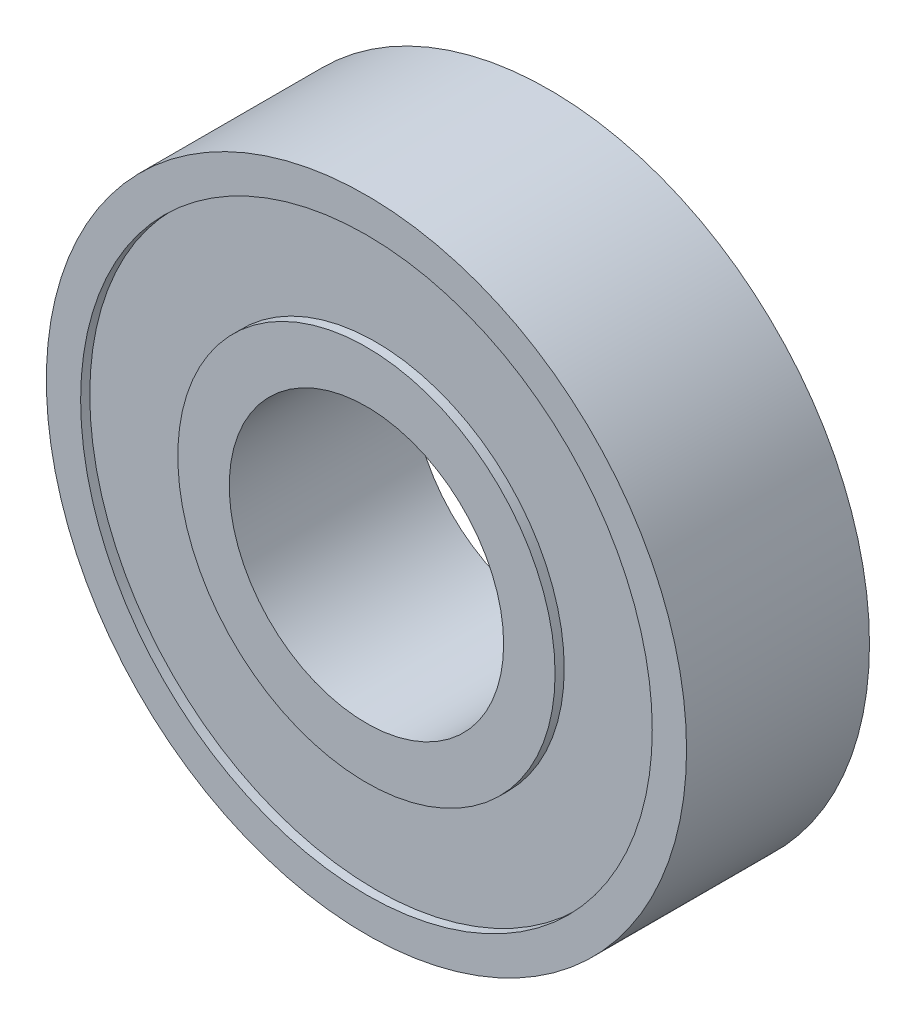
from build123d import *

# Parameters (mm, degrees)
SKETCH1_R          = 14
SKETCH1_R_2        = 6
EXTRUDE1_DEPTH     = 4
SKETCH2_R          = 12.5
SKETCH2_R_2        = 8.25
CUT_EXTRUDE1_DEPTH = 0.4


with BuildPart() as part:
    # Sketch1 → Extrude1 (new, symmetric)
    with BuildSketch(Plane.XY):
        Circle(SKETCH1_R)
        Circle(SKETCH1_R_2, mode=Mode.SUBTRACT)
    extrude(amount=EXTRUDE1_DEPTH, both=True)

    # Sketch2 → Cut-Extrude1 (cut)
    with BuildSketch(Plane.XY.offset(4)):
        Circle(SKETCH2_R)
        Circle(SKETCH2_R_2, mode=Mode.SUBTRACT)
    cut_extrude1 = extrude(amount=-CUT_EXTRUDE1_DEPTH, mode=Mode.SUBTRACT)

    # Mirror1: Cut-Extrude1 across plane
    add(cut_extrude1.mirror(Plane.XY), mode=Mode.SUBTRACT)


solid = part.part
